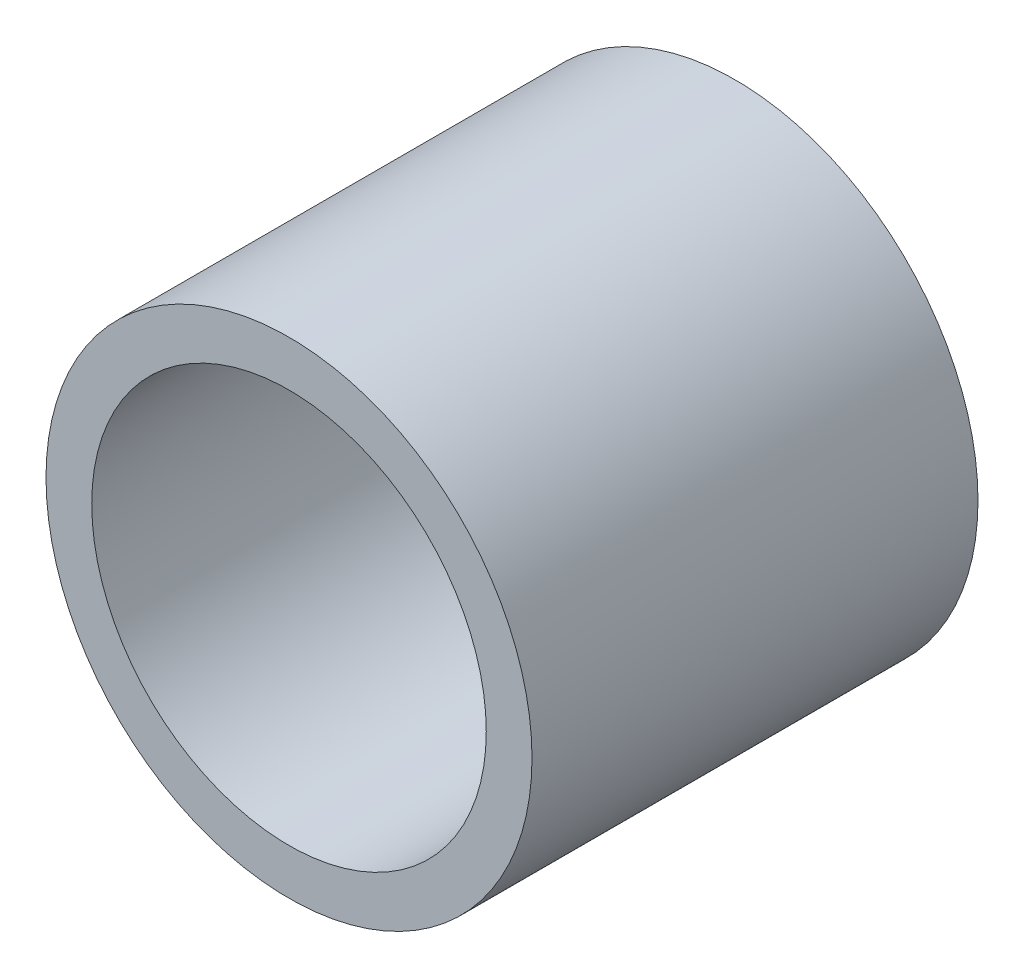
from build123d import *

# Parameters (mm, degrees)
SKETCH1_R          = 10.795
SKETCH1_R_2        = 8.763
BASE_EXTRUDE_DEPTH = 19.812


with BuildPart() as part:
    # Sketch1 → Base-Extrude (new body)
    with BuildSketch(Plane.XY):
        Circle(SKETCH1_R)
        Circle(SKETCH1_R_2, mode=Mode.SUBTRACT)
    extrude(amount=BASE_EXTRUDE_DEPTH)


solid = part.part
